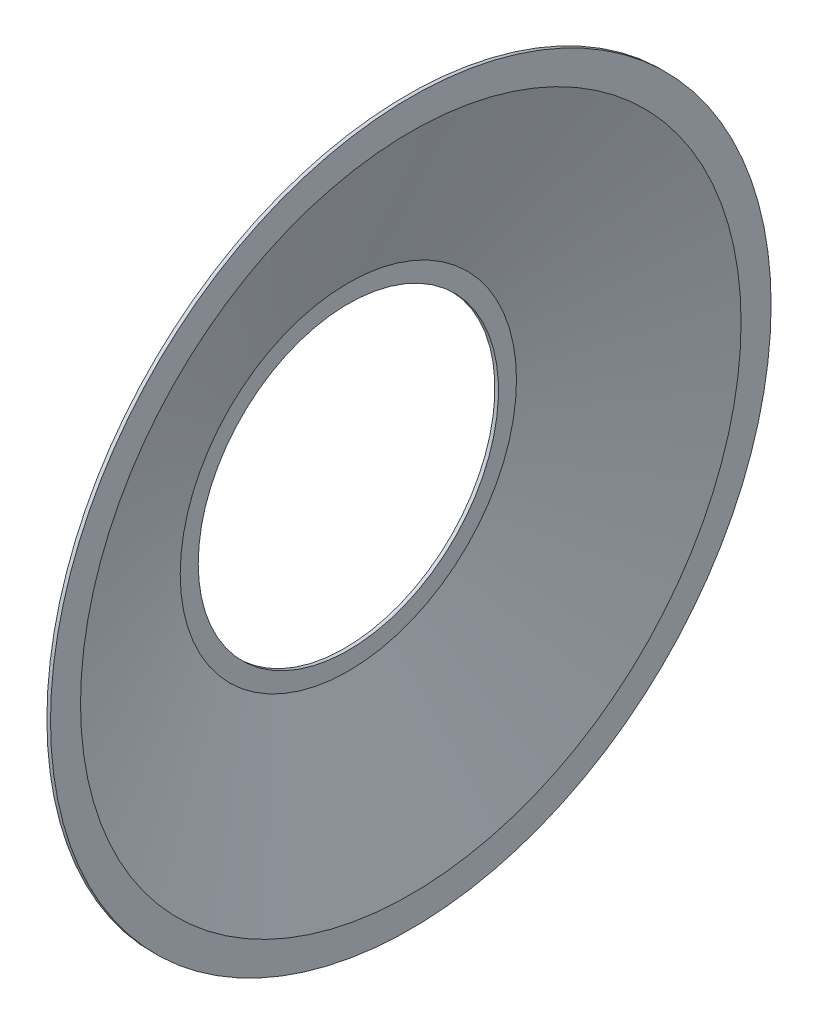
from build123d import *


with BuildPart() as part:
    # Sketch 1 → Revolve 1 (revolve)
    with BuildSketch(Plane.XY, mode=Mode.PRIVATE) as revolve_1_sk:
        Polygon((0.6, 25), (0, 25), (0, 28), (10.4, 55), (10.4, 60), (11, 60), (11, 55), (0.6, 28), align=None)
    revolve(revolve_1_sk.sketch.rotate(Axis((0, 0, 0), (1, 0, 0)), 90), axis=Axis((0, 0, 0), (1, 0, 0)))


solid = part.part
